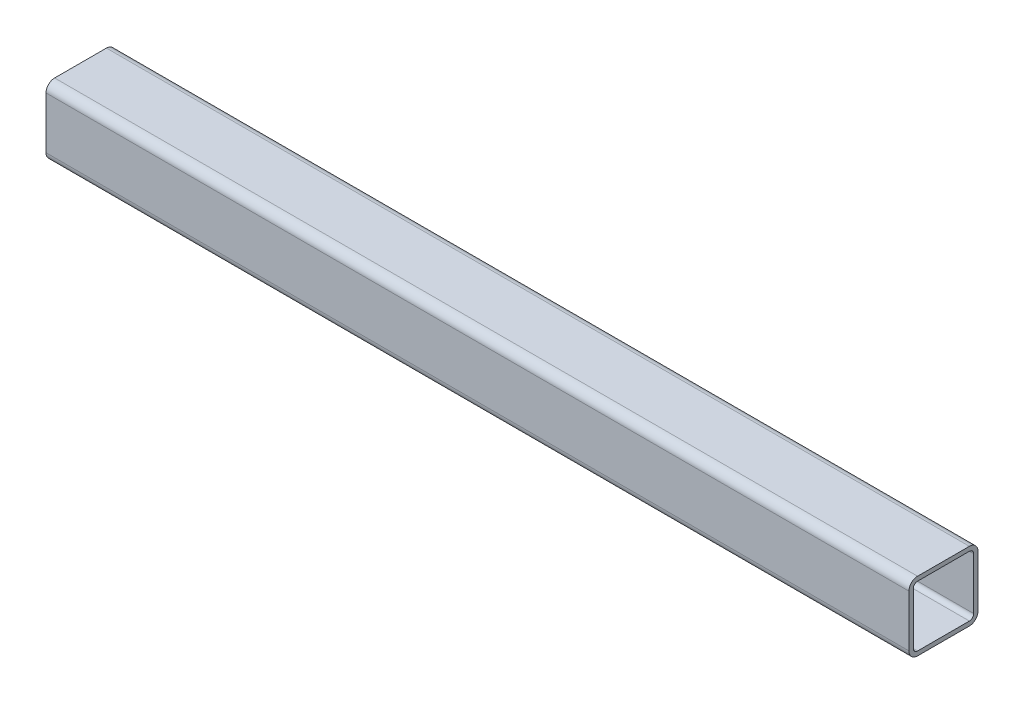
ISO-10303-21;
HEADER;
FILE_DESCRIPTION(('STEP AP214'),'2;1');
FILE_NAME('part.step','',(''),(''),'','','');
FILE_SCHEMA(('AUTOMOTIVE_DESIGN { 1 0 10303 214 1 1 1 1 }'));
ENDSEC;
DATA;
#1=APPLICATION_CONTEXT('core data for automotive mechanical design processes');
#2=APPLICATION_PROTOCOL_DEFINITION('international standard','automotive_design',2000,#1);
#3=PRODUCT_CONTEXT('',#1,'mechanical');
#4=PRODUCT('Part','Part','',(#3));
#5=PRODUCT_RELATED_PRODUCT_CATEGORY('part','',(#4));
#6=PRODUCT_DEFINITION_FORMATION('','',#4);
#7=PRODUCT_DEFINITION_CONTEXT('part definition',#1,'design');
#8=PRODUCT_DEFINITION('design','',#6,#7);
#9=PRODUCT_DEFINITION_SHAPE('','',#8);
#10=(LENGTH_UNIT() NAMED_UNIT(*) SI_UNIT(.MILLI.,.METRE.));
#11=(NAMED_UNIT(*) PLANE_ANGLE_UNIT() SI_UNIT($,.RADIAN.));
#12=(NAMED_UNIT(*) SI_UNIT($,.STERADIAN.) SOLID_ANGLE_UNIT());
#13=UNCERTAINTY_MEASURE_WITH_UNIT(LENGTH_MEASURE(1.E-05),#10,'distance_accuracy_value','');
#14=(GEOMETRIC_REPRESENTATION_CONTEXT(3) GLOBAL_UNCERTAINTY_ASSIGNED_CONTEXT((#13)) GLOBAL_UNIT_ASSIGNED_CONTEXT((#10,
#11,#12)) REPRESENTATION_CONTEXT('',''));
#15=CARTESIAN_POINT('',(0.,0.,0.));
#16=DIRECTION('',(0.,0.,1.));
#17=DIRECTION('',(1.,0.,0.));
#18=AXIS2_PLACEMENT_3D('',#15,#16,#17);
#19=CARTESIAN_POINT('',(635.,38.1,38.1));
#20=DIRECTION('',(-1.,0.,0.));
#21=DIRECTION('',(0.,0.,1.));
#22=AXIS2_PLACEMENT_3D('',#19,#20,#21);
#23=CYLINDRICAL_SURFACE('',#22,12.7);
#24=CARTESIAN_POINT('',(-635.,38.1,38.1));
#25=DIRECTION('',(1.,0.,0.));
#26=DIRECTION('',(0.,0.,-1.));
#27=AXIS2_PLACEMENT_3D('',#24,#25,#26);
#28=CIRCLE('',#27,12.7);
#29=CARTESIAN_POINT('',(-635.,50.8,38.1));
#30=VERTEX_POINT('',#29);
#31=CARTESIAN_POINT('',(-635.,38.1,50.8));
#32=VERTEX_POINT('',#31);
#33=EDGE_CURVE('E231',#30,#32,#28,.T.);
#34=ORIENTED_EDGE('',*,*,#33,.T.);
#35=DIRECTION('',(-1.,0.,0.));
#36=VECTOR('',#35,1.);
#37=CARTESIAN_POINT('',(635.,38.1,50.8));
#38=LINE('',#37,#36);
#39=CARTESIAN_POINT('',(635.,38.1,50.8));
#40=VERTEX_POINT('',#39);
#41=EDGE_CURVE('E12',#40,#32,#38,.T.);
#42=ORIENTED_EDGE('',*,*,#41,.F.);
#43=CARTESIAN_POINT('',(635.,38.1,38.1));
#44=DIRECTION('',(1.,0.,0.));
#45=DIRECTION('',(0.,0.,-1.));
#46=AXIS2_PLACEMENT_3D('',#43,#44,#45);
#47=CIRCLE('',#46,12.7);
#48=CARTESIAN_POINT('',(635.,50.8,38.1));
#49=VERTEX_POINT('',#48);
#50=EDGE_CURVE('E309',#49,#40,#47,.T.);
#51=ORIENTED_EDGE('',*,*,#50,.F.);
#52=DIRECTION('',(-1.,0.,0.));
#53=VECTOR('',#52,1.);
#54=CARTESIAN_POINT('',(635.,50.8,38.1));
#55=LINE('',#54,#53);
#56=EDGE_CURVE('E246',#49,#30,#55,.T.);
#57=ORIENTED_EDGE('',*,*,#56,.T.);
#58=EDGE_LOOP('',(#34,#42,#51,#57));
#59=FACE_BOUND('',#58,.T.);
#60=ADVANCED_FACE('F59',(#59),#23,.T.);
#61=CARTESIAN_POINT('',(635.,38.1,50.8));
#62=DIRECTION('',(0.,0.,-1.));
#63=DIRECTION('',(-1.,0.,0.));
#64=AXIS2_PLACEMENT_3D('',#61,#62,#63);
#65=PLANE('',#64);
#66=DIRECTION('',(0.,-1.,0.));
#67=VECTOR('',#66,1.);
#68=CARTESIAN_POINT('',(-635.,38.1,50.8));
#69=LINE('',#68,#67);
#70=CARTESIAN_POINT('',(-635.,-38.1,50.8));
#71=VERTEX_POINT('',#70);
#72=EDGE_CURVE('E234',#32,#71,#69,.T.);
#73=ORIENTED_EDGE('',*,*,#72,.T.);
#74=DIRECTION('',(-1.,0.,0.));
#75=VECTOR('',#74,1.);
#76=CARTESIAN_POINT('',(635.,-38.1,50.8));
#77=LINE('',#76,#75);
#78=CARTESIAN_POINT('',(635.,-38.1,50.8));
#79=VERTEX_POINT('',#78);
#80=EDGE_CURVE('E69',#79,#71,#77,.T.);
#81=ORIENTED_EDGE('',*,*,#80,.F.);
#82=DIRECTION('',(0.,-1.,0.));
#83=VECTOR('',#82,1.);
#84=CARTESIAN_POINT('',(635.,38.1,50.8));
#85=LINE('',#84,#83);
#86=EDGE_CURVE('E311',#40,#79,#85,.T.);
#87=ORIENTED_EDGE('',*,*,#86,.F.);
#88=ORIENTED_EDGE('',*,*,#41,.T.);
#89=EDGE_LOOP('',(#73,#81,#87,#88));
#90=FACE_BOUND('',#89,.T.);
#91=ADVANCED_FACE('F346',(#90),#65,.F.);
#92=CARTESIAN_POINT('',(635.,-38.1,38.1));
#93=DIRECTION('',(-1.,0.,0.));
#94=DIRECTION('',(0.,0.,1.));
#95=AXIS2_PLACEMENT_3D('',#92,#93,#94);
#96=CYLINDRICAL_SURFACE('',#95,12.7);
#97=CARTESIAN_POINT('',(-635.,-38.1,38.1));
#98=DIRECTION('',(1.,0.,0.));
#99=DIRECTION('',(0.,0.,-1.));
#100=AXIS2_PLACEMENT_3D('',#97,#98,#99);
#101=CIRCLE('',#100,12.7);
#102=CARTESIAN_POINT('',(-635.,-50.8,38.1));
#103=VERTEX_POINT('',#102);
#104=EDGE_CURVE('E236',#71,#103,#101,.T.);
#105=ORIENTED_EDGE('',*,*,#104,.T.);
#106=DIRECTION('',(-1.,0.,0.));
#107=VECTOR('',#106,1.);
#108=CARTESIAN_POINT('',(635.,-50.8,38.1));
#109=LINE('',#108,#107);
#110=CARTESIAN_POINT('',(635.,-50.8,38.1));
#111=VERTEX_POINT('',#110);
#112=EDGE_CURVE('E253',#111,#103,#109,.T.);
#113=ORIENTED_EDGE('',*,*,#112,.F.);
#114=CARTESIAN_POINT('',(635.,-38.1,38.1));
#115=DIRECTION('',(1.,0.,0.));
#116=DIRECTION('',(0.,0.,-1.));
#117=AXIS2_PLACEMENT_3D('',#114,#115,#116);
#118=CIRCLE('',#117,12.7);
#119=EDGE_CURVE('E313',#79,#111,#118,.T.);
#120=ORIENTED_EDGE('',*,*,#119,.F.);
#121=ORIENTED_EDGE('',*,*,#80,.T.);
#122=EDGE_LOOP('',(#105,#113,#120,#121));
#123=FACE_BOUND('',#122,.T.);
#124=ADVANCED_FACE('F351',(#123),#96,.T.);
#125=CARTESIAN_POINT('',(635.,-50.8,-38.1));
#126=DIRECTION('',(0.,1.,0.));
#127=DIRECTION('',(0.,0.,1.));
#128=AXIS2_PLACEMENT_3D('',#125,#126,#127);
#129=PLANE('',#128);
#130=DIRECTION('',(0.,0.,-1.));
#131=VECTOR('',#130,1.);
#132=CARTESIAN_POINT('',(-635.,-50.8,-38.1));
#133=LINE('',#132,#131);
#134=CARTESIAN_POINT('',(-635.,-50.8,-38.1));
#135=VERTEX_POINT('',#134);
#136=EDGE_CURVE('E238',#103,#135,#133,.T.);
#137=ORIENTED_EDGE('',*,*,#136,.T.);
#138=DIRECTION('',(-1.,0.,0.));
#139=VECTOR('',#138,1.);
#140=CARTESIAN_POINT('',(635.,-50.8,-38.1));
#141=LINE('',#140,#139);
#142=CARTESIAN_POINT('',(635.,-50.8,-38.1));
#143=VERTEX_POINT('',#142);
#144=EDGE_CURVE('E250',#143,#135,#141,.T.);
#145=ORIENTED_EDGE('',*,*,#144,.F.);
#146=DIRECTION('',(0.,0.,-1.));
#147=VECTOR('',#146,1.);
#148=CARTESIAN_POINT('',(635.,-50.8,-38.1));
#149=LINE('',#148,#147);
#150=EDGE_CURVE('E315',#111,#143,#149,.T.);
#151=ORIENTED_EDGE('',*,*,#150,.F.);
#152=ORIENTED_EDGE('',*,*,#112,.T.);
#153=EDGE_LOOP('',(#137,#145,#151,#152));
#154=FACE_BOUND('',#153,.T.);
#155=ADVANCED_FACE('F321',(#154),#129,.F.);
#156=CARTESIAN_POINT('',(635.,-38.1,-38.1));
#157=DIRECTION('',(-1.,0.,0.));
#158=DIRECTION('',(0.,0.,1.));
#159=AXIS2_PLACEMENT_3D('',#156,#157,#158);
#160=CYLINDRICAL_SURFACE('',#159,12.7);
#161=CARTESIAN_POINT('',(-635.,-38.1,-38.1));
#162=DIRECTION('',(1.,0.,0.));
#163=DIRECTION('',(0.,0.,-1.));
#164=AXIS2_PLACEMENT_3D('',#161,#162,#163);
#165=CIRCLE('',#164,12.7);
#166=CARTESIAN_POINT('',(-635.,-38.1,-50.8));
#167=VERTEX_POINT('',#166);
#168=EDGE_CURVE('E240',#135,#167,#165,.T.);
#169=ORIENTED_EDGE('',*,*,#168,.T.);
#170=DIRECTION('',(-1.,0.,0.));
#171=VECTOR('',#170,1.);
#172=CARTESIAN_POINT('',(635.,-38.1,-50.8));
#173=LINE('',#172,#171);
#174=CARTESIAN_POINT('',(635.,-38.1,-50.8));
#175=VERTEX_POINT('',#174);
#176=EDGE_CURVE('E198',#175,#167,#173,.T.);
#177=ORIENTED_EDGE('',*,*,#176,.F.);
#178=CARTESIAN_POINT('',(635.,-38.1,-38.1));
#179=DIRECTION('',(1.,0.,0.));
#180=DIRECTION('',(0.,0.,-1.));
#181=AXIS2_PLACEMENT_3D('',#178,#179,#180);
#182=CIRCLE('',#181,12.7);
#183=EDGE_CURVE('E189',#143,#175,#182,.T.);
#184=ORIENTED_EDGE('',*,*,#183,.F.);
#185=ORIENTED_EDGE('',*,*,#144,.T.);
#186=EDGE_LOOP('',(#169,#177,#184,#185));
#187=FACE_BOUND('',#186,.T.);
#188=ADVANCED_FACE('F325',(#187),#160,.T.);
#189=CARTESIAN_POINT('',(635.,-38.1,-50.8));
#190=DIRECTION('',(0.,0.,1.));
#191=DIRECTION('',(1.,0.,0.));
#192=AXIS2_PLACEMENT_3D('',#189,#190,#191);
#193=PLANE('',#192);
#194=DIRECTION('',(0.,1.,0.));
#195=VECTOR('',#194,1.);
#196=CARTESIAN_POINT('',(-635.,-38.1,-50.8));
#197=LINE('',#196,#195);
#198=CARTESIAN_POINT('',(-635.,38.1,-50.8));
#199=VERTEX_POINT('',#198);
#200=EDGE_CURVE('E197',#167,#199,#197,.T.);
#201=ORIENTED_EDGE('',*,*,#200,.T.);
#202=DIRECTION('',(-1.,0.,0.));
#203=VECTOR('',#202,1.);
#204=CARTESIAN_POINT('',(635.,38.1,-50.8));
#205=LINE('',#204,#203);
#206=CARTESIAN_POINT('',(635.,38.1,-50.8));
#207=VERTEX_POINT('',#206);
#208=EDGE_CURVE('E194',#207,#199,#205,.T.);
#209=ORIENTED_EDGE('',*,*,#208,.F.);
#210=DIRECTION('',(0.,1.,0.));
#211=VECTOR('',#210,1.);
#212=CARTESIAN_POINT('',(635.,-38.1,-50.8));
#213=LINE('',#212,#211);
#214=EDGE_CURVE('E183',#175,#207,#213,.T.);
#215=ORIENTED_EDGE('',*,*,#214,.F.);
#216=ORIENTED_EDGE('',*,*,#176,.T.);
#217=EDGE_LOOP('',(#201,#209,#215,#216));
#218=FACE_BOUND('',#217,.T.);
#219=ADVANCED_FACE('F195',(#218),#193,.F.);
#220=CARTESIAN_POINT('',(635.,38.1,-38.1));
#221=DIRECTION('',(-1.,0.,0.));
#222=DIRECTION('',(0.,0.,1.));
#223=AXIS2_PLACEMENT_3D('',#220,#221,#222);
#224=CYLINDRICAL_SURFACE('',#223,12.7);
#225=CARTESIAN_POINT('',(-635.,38.1,-38.1));
#226=DIRECTION('',(1.,0.,0.));
#227=DIRECTION('',(0.,0.,-1.));
#228=AXIS2_PLACEMENT_3D('',#225,#226,#227);
#229=CIRCLE('',#228,12.7);
#230=CARTESIAN_POINT('',(-635.,50.8,-38.1));
#231=VERTEX_POINT('',#230);
#232=EDGE_CURVE('E131',#199,#231,#229,.T.);
#233=ORIENTED_EDGE('',*,*,#232,.T.);
#234=DIRECTION('',(-1.,0.,0.));
#235=VECTOR('',#234,1.);
#236=CARTESIAN_POINT('',(635.,50.8,-38.1));
#237=LINE('',#236,#235);
#238=CARTESIAN_POINT('',(635.,50.8,-38.1));
#239=VERTEX_POINT('',#238);
#240=EDGE_CURVE('E199',#239,#231,#237,.T.);
#241=ORIENTED_EDGE('',*,*,#240,.F.);
#242=CARTESIAN_POINT('',(635.,38.1,-38.1));
#243=DIRECTION('',(1.,0.,0.));
#244=DIRECTION('',(0.,0.,-1.));
#245=AXIS2_PLACEMENT_3D('',#242,#243,#244);
#246=CIRCLE('',#245,12.7);
#247=EDGE_CURVE('E187',#207,#239,#246,.T.);
#248=ORIENTED_EDGE('',*,*,#247,.F.);
#249=ORIENTED_EDGE('',*,*,#208,.T.);
#250=EDGE_LOOP('',(#233,#241,#248,#249));
#251=FACE_BOUND('',#250,.T.);
#252=ADVANCED_FACE('F201',(#251),#224,.T.);
#253=CARTESIAN_POINT('',(635.,-38.1,38.1));
#254=DIRECTION('',(-1.,0.,0.));
#255=DIRECTION('',(0.,0.,1.));
#256=AXIS2_PLACEMENT_3D('',#253,#254,#255);
#257=CYLINDRICAL_SURFACE('',#256,6.34999999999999);
#258=CARTESIAN_POINT('',(-635.,-38.1,38.1));
#259=DIRECTION('',(1.,0.,0.));
#260=DIRECTION('',(0.,0.,-1.));
#261=AXIS2_PLACEMENT_3D('',#258,#259,#260);
#262=CIRCLE('',#261,6.34999999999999);
#263=CARTESIAN_POINT('',(-635.,-38.1,44.45));
#264=VERTEX_POINT('',#263);
#265=CARTESIAN_POINT('',(-635.,-44.45,38.1));
#266=VERTEX_POINT('',#265);
#267=EDGE_CURVE('E207',#264,#266,#262,.T.);
#268=ORIENTED_EDGE('',*,*,#267,.F.);
#269=DIRECTION('',(-1.,0.,0.));
#270=VECTOR('',#269,1.);
#271=CARTESIAN_POINT('',(635.,-38.1,44.45));
#272=LINE('',#271,#270);
#273=CARTESIAN_POINT('',(635.,-38.1,44.45));
#274=VERTEX_POINT('',#273);
#275=EDGE_CURVE('E63',#274,#264,#272,.T.);
#276=ORIENTED_EDGE('',*,*,#275,.F.);
#277=CARTESIAN_POINT('',(635.,-38.1,38.1));
#278=DIRECTION('',(1.,0.,0.));
#279=DIRECTION('',(0.,0.,-1.));
#280=AXIS2_PLACEMENT_3D('',#277,#278,#279);
#281=CIRCLE('',#280,6.34999999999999);
#282=CARTESIAN_POINT('',(635.,-44.45,38.1));
#283=VERTEX_POINT('',#282);
#284=EDGE_CURVE('E245',#274,#283,#281,.T.);
#285=ORIENTED_EDGE('',*,*,#284,.T.);
#286=DIRECTION('',(-1.,0.,0.));
#287=VECTOR('',#286,1.);
#288=CARTESIAN_POINT('',(635.,-44.45,38.1));
#289=LINE('',#288,#287);
#290=EDGE_CURVE('E203',#283,#266,#289,.T.);
#291=ORIENTED_EDGE('',*,*,#290,.T.);
#292=EDGE_LOOP('',(#268,#276,#285,#291));
#293=FACE_BOUND('',#292,.T.);
#294=ADVANCED_FACE('F61',(#293),#257,.F.);
#295=CARTESIAN_POINT('',(635.,38.1,44.45));
#296=DIRECTION('',(0.,0.,-1.));
#297=DIRECTION('',(-1.,0.,0.));
#298=AXIS2_PLACEMENT_3D('',#295,#296,#297);
#299=PLANE('',#298);
#300=DIRECTION('',(0.,-1.,0.));
#301=VECTOR('',#300,1.);
#302=CARTESIAN_POINT('',(-635.,38.1,44.45));
#303=LINE('',#302,#301);
#304=CARTESIAN_POINT('',(-635.,38.1,44.45));
#305=VERTEX_POINT('',#304);
#306=EDGE_CURVE('E210',#305,#264,#303,.T.);
#307=ORIENTED_EDGE('',*,*,#306,.F.);
#308=DIRECTION('',(-1.,0.,0.));
#309=VECTOR('',#308,1.);
#310=CARTESIAN_POINT('',(635.,38.1,44.45));
#311=LINE('',#310,#309);
#312=CARTESIAN_POINT('',(635.,38.1,44.45));
#313=VERTEX_POINT('',#312);
#314=EDGE_CURVE('E268',#313,#305,#311,.T.);
#315=ORIENTED_EDGE('',*,*,#314,.F.);
#316=DIRECTION('',(0.,-1.,0.));
#317=VECTOR('',#316,1.);
#318=CARTESIAN_POINT('',(635.,38.1,44.45));
#319=LINE('',#318,#317);
#320=EDGE_CURVE('E277',#313,#274,#319,.T.);
#321=ORIENTED_EDGE('',*,*,#320,.T.);
#322=ORIENTED_EDGE('',*,*,#275,.T.);
#323=EDGE_LOOP('',(#307,#315,#321,#322));
#324=FACE_BOUND('',#323,.T.);
#325=ADVANCED_FACE('F275',(#324),#299,.T.);
#326=CARTESIAN_POINT('',(635.,38.1,38.1));
#327=DIRECTION('',(-1.,0.,0.));
#328=DIRECTION('',(0.,0.,1.));
#329=AXIS2_PLACEMENT_3D('',#326,#327,#328);
#330=CYLINDRICAL_SURFACE('',#329,6.34999999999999);
#331=CARTESIAN_POINT('',(-635.,38.1,38.1));
#332=DIRECTION('',(1.,0.,0.));
#333=DIRECTION('',(0.,0.,-1.));
#334=AXIS2_PLACEMENT_3D('',#331,#332,#333);
#335=CIRCLE('',#334,6.34999999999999);
#336=CARTESIAN_POINT('',(-635.,44.45,38.1));
#337=VERTEX_POINT('',#336);
#338=EDGE_CURVE('E213',#337,#305,#335,.T.);
#339=ORIENTED_EDGE('',*,*,#338,.F.);
#340=DIRECTION('',(-1.,0.,0.));
#341=VECTOR('',#340,1.);
#342=CARTESIAN_POINT('',(635.,44.45,38.1));
#343=LINE('',#342,#341);
#344=CARTESIAN_POINT('',(635.,44.45,38.1));
#345=VERTEX_POINT('',#344);
#346=EDGE_CURVE('E267',#345,#337,#343,.T.);
#347=ORIENTED_EDGE('',*,*,#346,.F.);
#348=CARTESIAN_POINT('',(635.,38.1,38.1));
#349=DIRECTION('',(1.,0.,0.));
#350=DIRECTION('',(0.,0.,-1.));
#351=AXIS2_PLACEMENT_3D('',#348,#349,#350);
#352=CIRCLE('',#351,6.34999999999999);
#353=EDGE_CURVE('E285',#345,#313,#352,.T.);
#354=ORIENTED_EDGE('',*,*,#353,.T.);
#355=ORIENTED_EDGE('',*,*,#314,.T.);
#356=EDGE_LOOP('',(#339,#347,#354,#355));
#357=FACE_BOUND('',#356,.T.);
#358=ADVANCED_FACE('F283',(#357),#330,.F.);
#359=CARTESIAN_POINT('',(635.,44.45,38.1));
#360=DIRECTION('',(0.,-1.,0.));
#361=DIRECTION('',(0.,0.,-1.));
#362=AXIS2_PLACEMENT_3D('',#359,#360,#361);
#363=PLANE('',#362);
#364=DIRECTION('',(0.,0.,1.));
#365=VECTOR('',#364,1.);
#366=CARTESIAN_POINT('',(-635.,44.45,38.1));
#367=LINE('',#366,#365);
#368=CARTESIAN_POINT('',(-635.,44.45,-38.1));
#369=VERTEX_POINT('',#368);
#370=EDGE_CURVE('E216',#369,#337,#367,.T.);
#371=ORIENTED_EDGE('',*,*,#370,.F.);
#372=DIRECTION('',(-1.,0.,0.));
#373=VECTOR('',#372,1.);
#374=CARTESIAN_POINT('',(635.,44.45,-38.1));
#375=LINE('',#374,#373);
#376=CARTESIAN_POINT('',(635.,44.45,-38.1));
#377=VERTEX_POINT('',#376);
#378=EDGE_CURVE('E265',#377,#369,#375,.T.);
#379=ORIENTED_EDGE('',*,*,#378,.F.);
#380=DIRECTION('',(0.,0.,1.));
#381=VECTOR('',#380,1.);
#382=CARTESIAN_POINT('',(635.,44.45,38.1));
#383=LINE('',#382,#381);
#384=EDGE_CURVE('E291',#377,#345,#383,.T.);
#385=ORIENTED_EDGE('',*,*,#384,.T.);
#386=ORIENTED_EDGE('',*,*,#346,.T.);
#387=EDGE_LOOP('',(#371,#379,#385,#386));
#388=FACE_BOUND('',#387,.T.);
#389=ADVANCED_FACE('F294',(#388),#363,.T.);
#390=CARTESIAN_POINT('',(635.,38.1,-38.1));
#391=DIRECTION('',(-1.,0.,0.));
#392=DIRECTION('',(0.,0.,1.));
#393=AXIS2_PLACEMENT_3D('',#390,#391,#392);
#394=CYLINDRICAL_SURFACE('',#393,6.34999999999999);
#395=CARTESIAN_POINT('',(-635.,38.1,-38.1));
#396=DIRECTION('',(1.,0.,0.));
#397=DIRECTION('',(0.,0.,-1.));
#398=AXIS2_PLACEMENT_3D('',#395,#396,#397);
#399=CIRCLE('',#398,6.34999999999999);
#400=CARTESIAN_POINT('',(-635.,38.1,-44.45));
#401=VERTEX_POINT('',#400);
#402=EDGE_CURVE('E219',#401,#369,#399,.T.);
#403=ORIENTED_EDGE('',*,*,#402,.F.);
#404=DIRECTION('',(-1.,0.,0.));
#405=VECTOR('',#404,1.);
#406=CARTESIAN_POINT('',(635.,38.1,-44.45));
#407=LINE('',#406,#405);
#408=CARTESIAN_POINT('',(635.,38.1,-44.45));
#409=VERTEX_POINT('',#408);
#410=EDGE_CURVE('E263',#409,#401,#407,.T.);
#411=ORIENTED_EDGE('',*,*,#410,.F.);
#412=CARTESIAN_POINT('',(635.,38.1,-38.1));
#413=DIRECTION('',(1.,0.,0.));
#414=DIRECTION('',(0.,0.,-1.));
#415=AXIS2_PLACEMENT_3D('',#412,#413,#414);
#416=CIRCLE('',#415,6.34999999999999);
#417=EDGE_CURVE('E295',#409,#377,#416,.T.);
#418=ORIENTED_EDGE('',*,*,#417,.T.);
#419=ORIENTED_EDGE('',*,*,#378,.T.);
#420=EDGE_LOOP('',(#403,#411,#418,#419));
#421=FACE_BOUND('',#420,.T.);
#422=ADVANCED_FACE('F362',(#421),#394,.F.);
#423=CARTESIAN_POINT('',(635.,-38.1,-44.45));
#424=DIRECTION('',(0.,0.,1.));
#425=DIRECTION('',(1.,0.,0.));
#426=AXIS2_PLACEMENT_3D('',#423,#424,#425);
#427=PLANE('',#426);
#428=DIRECTION('',(0.,1.,0.));
#429=VECTOR('',#428,1.);
#430=CARTESIAN_POINT('',(-635.,-38.1,-44.45));
#431=LINE('',#430,#429);
#432=CARTESIAN_POINT('',(-635.,-38.1,-44.45));
#433=VERTEX_POINT('',#432);
#434=EDGE_CURVE('E222',#433,#401,#431,.T.);
#435=ORIENTED_EDGE('',*,*,#434,.F.);
#436=DIRECTION('',(-1.,0.,0.));
#437=VECTOR('',#436,1.);
#438=CARTESIAN_POINT('',(635.,-38.1,-44.45));
#439=LINE('',#438,#437);
#440=CARTESIAN_POINT('',(635.,-38.1,-44.45));
#441=VERTEX_POINT('',#440);
#442=EDGE_CURVE('E261',#441,#433,#439,.T.);
#443=ORIENTED_EDGE('',*,*,#442,.F.);
#444=DIRECTION('',(0.,1.,0.));
#445=VECTOR('',#444,1.);
#446=CARTESIAN_POINT('',(635.,-38.1,-44.45));
#447=LINE('',#446,#445);
#448=EDGE_CURVE('E297',#441,#409,#447,.T.);
#449=ORIENTED_EDGE('',*,*,#448,.T.);
#450=ORIENTED_EDGE('',*,*,#410,.T.);
#451=EDGE_LOOP('',(#435,#443,#449,#450));
#452=FACE_BOUND('',#451,.T.);
#453=ADVANCED_FACE('F358',(#452),#427,.T.);
#454=CARTESIAN_POINT('',(635.,-38.1,-38.1));
#455=DIRECTION('',(-1.,0.,0.));
#456=DIRECTION('',(0.,0.,1.));
#457=AXIS2_PLACEMENT_3D('',#454,#455,#456);
#458=CYLINDRICAL_SURFACE('',#457,6.34999999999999);
#459=CARTESIAN_POINT('',(-635.,-38.1,-38.1));
#460=DIRECTION('',(1.,0.,0.));
#461=DIRECTION('',(0.,0.,-1.));
#462=AXIS2_PLACEMENT_3D('',#459,#460,#461);
#463=CIRCLE('',#462,6.34999999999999);
#464=CARTESIAN_POINT('',(-635.,-44.45,-38.1));
#465=VERTEX_POINT('',#464);
#466=EDGE_CURVE('E225',#465,#433,#463,.T.);
#467=ORIENTED_EDGE('',*,*,#466,.F.);
#468=DIRECTION('',(-1.,0.,0.));
#469=VECTOR('',#468,1.);
#470=CARTESIAN_POINT('',(635.,-44.45,-38.1));
#471=LINE('',#470,#469);
#472=CARTESIAN_POINT('',(635.,-44.45,-38.1));
#473=VERTEX_POINT('',#472);
#474=EDGE_CURVE('E259',#473,#465,#471,.T.);
#475=ORIENTED_EDGE('',*,*,#474,.F.);
#476=CARTESIAN_POINT('',(635.,-38.1,-38.1));
#477=DIRECTION('',(1.,0.,0.));
#478=DIRECTION('',(0.,0.,-1.));
#479=AXIS2_PLACEMENT_3D('',#476,#477,#478);
#480=CIRCLE('',#479,6.34999999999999);
#481=EDGE_CURVE('E303',#473,#441,#480,.T.);
#482=ORIENTED_EDGE('',*,*,#481,.T.);
#483=ORIENTED_EDGE('',*,*,#442,.T.);
#484=EDGE_LOOP('',(#467,#475,#482,#483));
#485=FACE_BOUND('',#484,.T.);
#486=ADVANCED_FACE('F340',(#485),#458,.F.);
#487=CARTESIAN_POINT('',(635.,-44.45,-38.1));
#488=DIRECTION('',(0.,1.,0.));
#489=DIRECTION('',(0.,0.,1.));
#490=AXIS2_PLACEMENT_3D('',#487,#488,#489);
#491=PLANE('',#490);
#492=DIRECTION('',(0.,0.,-1.));
#493=VECTOR('',#492,1.);
#494=CARTESIAN_POINT('',(-635.,-44.45,-38.1));
#495=LINE('',#494,#493);
#496=EDGE_CURVE('E228',#266,#465,#495,.T.);
#497=ORIENTED_EDGE('',*,*,#496,.F.);
#498=ORIENTED_EDGE('',*,*,#290,.F.);
#499=DIRECTION('',(0.,0.,-1.));
#500=VECTOR('',#499,1.);
#501=CARTESIAN_POINT('',(635.,-44.45,-38.1));
#502=LINE('',#501,#500);
#503=EDGE_CURVE('E306',#283,#473,#502,.T.);
#504=ORIENTED_EDGE('',*,*,#503,.T.);
#505=ORIENTED_EDGE('',*,*,#474,.T.);
#506=EDGE_LOOP('',(#497,#498,#504,#505));
#507=FACE_BOUND('',#506,.T.);
#508=ADVANCED_FACE('F333',(#507),#491,.T.);
#509=CARTESIAN_POINT('',(635.,50.8,38.1));
#510=DIRECTION('',(0.,-1.,0.));
#511=DIRECTION('',(0.,0.,-1.));
#512=AXIS2_PLACEMENT_3D('',#509,#510,#511);
#513=PLANE('',#512);
#514=DIRECTION('',(0.,0.,1.));
#515=VECTOR('',#514,1.);
#516=CARTESIAN_POINT('',(-635.,50.8,38.1));
#517=LINE('',#516,#515);
#518=EDGE_CURVE('E137',#231,#30,#517,.T.);
#519=ORIENTED_EDGE('',*,*,#518,.T.);
#520=ORIENTED_EDGE('',*,*,#56,.F.);
#521=DIRECTION('',(0.,0.,1.));
#522=VECTOR('',#521,1.);
#523=CARTESIAN_POINT('',(635.,50.8,38.1));
#524=LINE('',#523,#522);
#525=EDGE_CURVE('E78',#239,#49,#524,.T.);
#526=ORIENTED_EDGE('',*,*,#525,.F.);
#527=ORIENTED_EDGE('',*,*,#240,.T.);
#528=EDGE_LOOP('',(#519,#520,#526,#527));
#529=FACE_BOUND('',#528,.T.);
#530=ADVANCED_FACE('F331',(#529),#513,.F.);
#531=CARTESIAN_POINT('',(635.,38.1,38.1));
#532=DIRECTION('',(1.,0.,0.));
#533=DIRECTION('',(0.,0.,-1.));
#534=AXIS2_PLACEMENT_3D('',#531,#532,#533);
#535=PLANE('',#534);
#536=ORIENTED_EDGE('',*,*,#284,.F.);
#537=ORIENTED_EDGE('',*,*,#320,.F.);
#538=ORIENTED_EDGE('',*,*,#353,.F.);
#539=ORIENTED_EDGE('',*,*,#384,.F.);
#540=ORIENTED_EDGE('',*,*,#417,.F.);
#541=ORIENTED_EDGE('',*,*,#448,.F.);
#542=ORIENTED_EDGE('',*,*,#481,.F.);
#543=ORIENTED_EDGE('',*,*,#503,.F.);
#544=EDGE_LOOP('',(#536,#537,#538,#539,#540,#541,#542,#543));
#545=FACE_BOUND('',#544,.T.);
#546=ORIENTED_EDGE('',*,*,#50,.T.);
#547=ORIENTED_EDGE('',*,*,#86,.T.);
#548=ORIENTED_EDGE('',*,*,#119,.T.);
#549=ORIENTED_EDGE('',*,*,#150,.T.);
#550=ORIENTED_EDGE('',*,*,#183,.T.);
#551=ORIENTED_EDGE('',*,*,#214,.T.);
#552=ORIENTED_EDGE('',*,*,#247,.T.);
#553=ORIENTED_EDGE('',*,*,#525,.T.);
#554=EDGE_LOOP('',(#546,#547,#548,#549,#550,#551,#552,#553));
#555=FACE_BOUND('',#554,.T.);
#556=ADVANCED_FACE('F185',(#545,#555),#535,.T.);
#557=CARTESIAN_POINT('',(-635.,38.1,38.1));
#558=DIRECTION('',(1.,0.,0.));
#559=DIRECTION('',(0.,0.,-1.));
#560=AXIS2_PLACEMENT_3D('',#557,#558,#559);
#561=PLANE('',#560);
#562=ORIENTED_EDGE('',*,*,#267,.T.);
#563=ORIENTED_EDGE('',*,*,#496,.T.);
#564=ORIENTED_EDGE('',*,*,#466,.T.);
#565=ORIENTED_EDGE('',*,*,#434,.T.);
#566=ORIENTED_EDGE('',*,*,#402,.T.);
#567=ORIENTED_EDGE('',*,*,#370,.T.);
#568=ORIENTED_EDGE('',*,*,#338,.T.);
#569=ORIENTED_EDGE('',*,*,#306,.T.);
#570=EDGE_LOOP('',(#562,#563,#564,#565,#566,#567,#568,#569));
#571=FACE_BOUND('',#570,.T.);
#572=ORIENTED_EDGE('',*,*,#33,.F.);
#573=ORIENTED_EDGE('',*,*,#518,.F.);
#574=ORIENTED_EDGE('',*,*,#232,.F.);
#575=ORIENTED_EDGE('',*,*,#200,.F.);
#576=ORIENTED_EDGE('',*,*,#168,.F.);
#577=ORIENTED_EDGE('',*,*,#136,.F.);
#578=ORIENTED_EDGE('',*,*,#104,.F.);
#579=ORIENTED_EDGE('',*,*,#72,.F.);
#580=EDGE_LOOP('',(#572,#573,#574,#575,#576,#577,#578,#579));
#581=FACE_BOUND('',#580,.T.);
#582=ADVANCED_FACE('F280',(#571,#581),#561,.F.);
#583=CLOSED_SHELL('',(#60,#91,#124,#155,#188,#219,#252,#294,#325,#358,#389,#422,#453,#486,#508,
#530,#556,#582));
#584=MANIFOLD_SOLID_BREP('B2',#583);
#585=ADVANCED_BREP_SHAPE_REPRESENTATION('',(#18,#584),#14);
#586=SHAPE_DEFINITION_REPRESENTATION(#9,#585);
ENDSEC;
END-ISO-10303-21;
